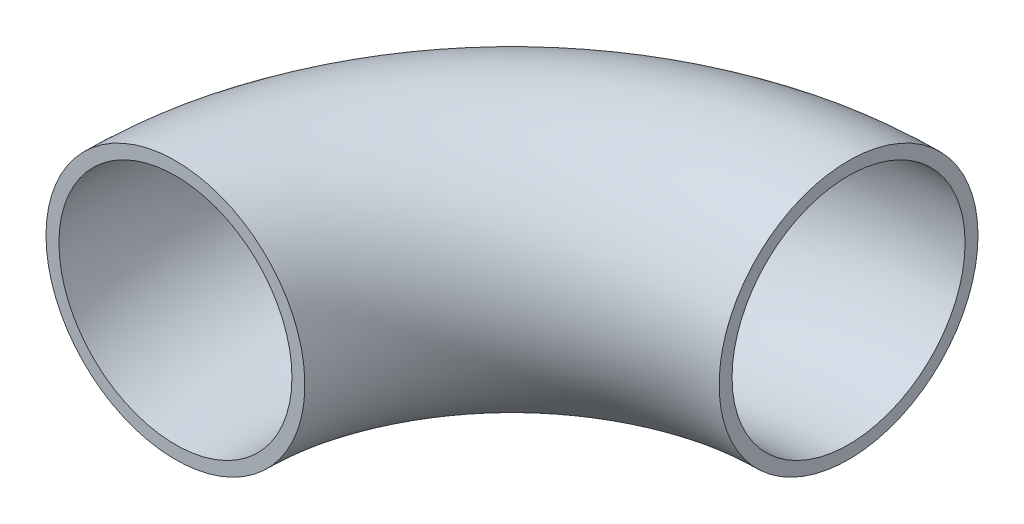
ISO-10303-21;
HEADER;
FILE_DESCRIPTION(('STEP AP214'),'2;1');
FILE_NAME('part.step','',(''),(''),'','','');
FILE_SCHEMA(('AUTOMOTIVE_DESIGN { 1 0 10303 214 1 1 1 1 }'));
ENDSEC;
DATA;
#1=APPLICATION_CONTEXT('core data for automotive mechanical design processes');
#2=APPLICATION_PROTOCOL_DEFINITION('international standard','automotive_design',2000,#1);
#3=PRODUCT_CONTEXT('',#1,'mechanical');
#4=PRODUCT('Part','Part','',(#3));
#5=PRODUCT_RELATED_PRODUCT_CATEGORY('part','',(#4));
#6=PRODUCT_DEFINITION_FORMATION('','',#4);
#7=PRODUCT_DEFINITION_CONTEXT('part definition',#1,'design');
#8=PRODUCT_DEFINITION('design','',#6,#7);
#9=PRODUCT_DEFINITION_SHAPE('','',#8);
#10=(LENGTH_UNIT() NAMED_UNIT(*) SI_UNIT(.MILLI.,.METRE.));
#11=(NAMED_UNIT(*) PLANE_ANGLE_UNIT() SI_UNIT($,.RADIAN.));
#12=(NAMED_UNIT(*) SI_UNIT($,.STERADIAN.) SOLID_ANGLE_UNIT());
#13=UNCERTAINTY_MEASURE_WITH_UNIT(LENGTH_MEASURE(1.E-05),#10,'distance_accuracy_value','');
#14=(GEOMETRIC_REPRESENTATION_CONTEXT(3) GLOBAL_UNCERTAINTY_ASSIGNED_CONTEXT((#13)) GLOBAL_UNIT_ASSIGNED_CONTEXT((#10,
#11,#12)) REPRESENTATION_CONTEXT('',''));
#15=CARTESIAN_POINT('',(0.,0.,0.));
#16=DIRECTION('',(0.,0.,1.));
#17=DIRECTION('',(1.,0.,0.));
#18=AXIS2_PLACEMENT_3D('',#15,#16,#17);
#19=CARTESIAN_POINT('',(39.,0.,0.));
#20=DIRECTION('',(0.,1.,0.));
#21=DIRECTION('',(0.,0.,1.));
#22=AXIS2_PLACEMENT_3D('',#19,#20,#21);
#23=TOROIDAL_SURFACE('',#22,39.,15.);
#24=CARTESIAN_POINT('',(39.,0.,-39.));
#25=DIRECTION('',(-1.,0.,0.));
#26=DIRECTION('',(0.,0.,1.));
#27=AXIS2_PLACEMENT_3D('',#24,#25,#26);
#28=CIRCLE('',#27,15.);
#29=CARTESIAN_POINT('',(39.,0.,-54.));
#30=VERTEX_POINT('',#29);
#31=EDGE_CURVE('E10',#30,#30,#28,.T.);
#32=CARTESIAN_POINT('',(0.,0.,0.));
#33=DIRECTION('',(0.,0.,1.));
#34=DIRECTION('',(1.,0.,0.));
#35=AXIS2_PLACEMENT_3D('',#32,#33,#34);
#36=CIRCLE('',#35,15.);
#37=CARTESIAN_POINT('',(-15.,0.,0.));
#38=VERTEX_POINT('',#37);
#39=EDGE_CURVE('E34',#38,#38,#36,.T.);
#40=CARTESIAN_POINT('',(39.,0.,0.));
#41=DIRECTION('',(0.,1.,0.));
#42=DIRECTION('',(0.,0.,1.));
#43=AXIS2_PLACEMENT_3D('',#40,#41,#42);
#44=CIRCLE('',#43,54.);
#45=EDGE_CURVE('',#30,#38,#44,.T.);
#46=ORIENTED_EDGE('',*,*,#31,.T.);
#47=ORIENTED_EDGE('',*,*,#39,.F.);
#48=ORIENTED_EDGE('',*,*,#45,.T.);
#49=ORIENTED_EDGE('',*,*,#45,.F.);
#50=EDGE_LOOP('',(#46,#48,#47,#49));
#51=FACE_BOUND('',#50,.T.);
#52=ADVANCED_FACE('F28',(#51),#23,.T.);
#53=CARTESIAN_POINT('',(39.,0.,-39.));
#54=DIRECTION('',(-1.,0.,0.));
#55=DIRECTION('',(0.,0.,1.));
#56=AXIS2_PLACEMENT_3D('',#53,#54,#55);
#57=PLANE('',#56);
#58=CARTESIAN_POINT('',(39.,0.,-39.));
#59=DIRECTION('',(-1.,0.,0.));
#60=DIRECTION('',(0.,0.,1.));
#61=AXIS2_PLACEMENT_3D('',#58,#59,#60);
#62=CIRCLE('',#61,13.5);
#63=CARTESIAN_POINT('',(39.,0.,-52.5));
#64=VERTEX_POINT('',#63);
#65=EDGE_CURVE('E38',#64,#64,#62,.T.);
#66=ORIENTED_EDGE('',*,*,#65,.T.);
#67=EDGE_LOOP('',(#66));
#68=FACE_BOUND('',#67,.T.);
#69=ORIENTED_EDGE('',*,*,#31,.F.);
#70=EDGE_LOOP('',(#69));
#71=FACE_BOUND('',#70,.T.);
#72=ADVANCED_FACE('F52',(#68,#71),#57,.F.);
#73=CARTESIAN_POINT('',(0.,0.,0.));
#74=DIRECTION('',(0.,0.,1.));
#75=DIRECTION('',(1.,0.,0.));
#76=AXIS2_PLACEMENT_3D('',#73,#74,#75);
#77=PLANE('',#76);
#78=CARTESIAN_POINT('',(0.,0.,0.));
#79=DIRECTION('',(0.,0.,1.));
#80=DIRECTION('',(1.,0.,0.));
#81=AXIS2_PLACEMENT_3D('',#78,#79,#80);
#82=CIRCLE('',#81,13.5);
#83=CARTESIAN_POINT('',(-13.5,0.,0.));
#84=VERTEX_POINT('',#83);
#85=EDGE_CURVE('E42',#84,#84,#82,.T.);
#86=ORIENTED_EDGE('',*,*,#85,.F.);
#87=EDGE_LOOP('',(#86));
#88=FACE_BOUND('',#87,.T.);
#89=ORIENTED_EDGE('',*,*,#39,.T.);
#90=EDGE_LOOP('',(#89));
#91=FACE_BOUND('',#90,.T.);
#92=ADVANCED_FACE('F50',(#88,#91),#77,.T.);
#93=CARTESIAN_POINT('',(39.,0.,0.));
#94=DIRECTION('',(0.,1.,0.));
#95=DIRECTION('',(0.,0.,1.));
#96=AXIS2_PLACEMENT_3D('',#93,#94,#95);
#97=TOROIDAL_SURFACE('',#96,39.,13.5);
#98=CARTESIAN_POINT('',(39.,0.,0.));
#99=DIRECTION('',(0.,1.,0.));
#100=DIRECTION('',(0.,0.,1.));
#101=AXIS2_PLACEMENT_3D('',#98,#99,#100);
#102=CIRCLE('',#101,52.5);
#103=EDGE_CURVE('',#64,#84,#102,.T.);
#104=ORIENTED_EDGE('',*,*,#65,.F.);
#105=ORIENTED_EDGE('',*,*,#85,.T.);
#106=ORIENTED_EDGE('',*,*,#103,.T.);
#107=ORIENTED_EDGE('',*,*,#103,.F.);
#108=EDGE_LOOP('',(#104,#106,#105,#107));
#109=FACE_BOUND('',#108,.T.);
#110=ADVANCED_FACE('F48',(#109),#97,.F.);
#111=CLOSED_SHELL('',(#52,#72,#92,#110));
#112=MANIFOLD_SOLID_BREP('B2',#111);
#113=ADVANCED_BREP_SHAPE_REPRESENTATION('',(#18,#112),#14);
#114=SHAPE_DEFINITION_REPRESENTATION(#9,#113);
ENDSEC;
END-ISO-10303-21;
